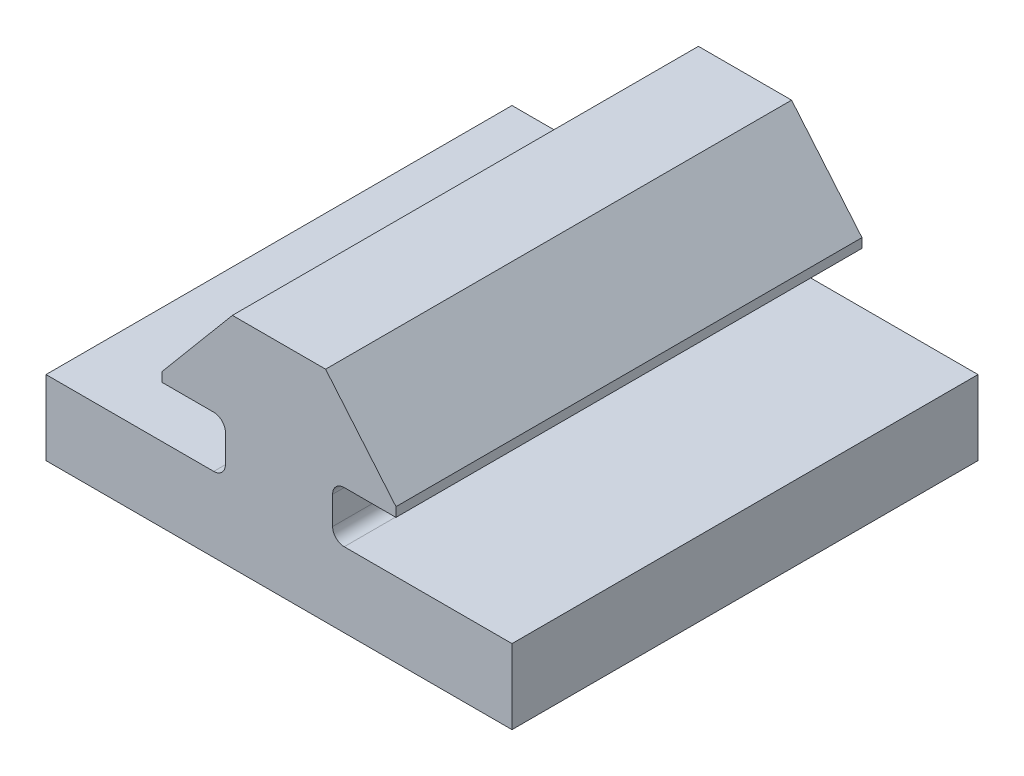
ISO-10303-21;
HEADER;
FILE_DESCRIPTION(('STEP AP214'),'2;1');
FILE_NAME('part.step','',(''),(''),'','','');
FILE_SCHEMA(('AUTOMOTIVE_DESIGN { 1 0 10303 214 1 1 1 1 }'));
ENDSEC;
DATA;
#1=APPLICATION_CONTEXT('core data for automotive mechanical design processes');
#2=APPLICATION_PROTOCOL_DEFINITION('international standard','automotive_design',2000,#1);
#3=PRODUCT_CONTEXT('',#1,'mechanical');
#4=PRODUCT('Part','Part','',(#3));
#5=PRODUCT_RELATED_PRODUCT_CATEGORY('part','',(#4));
#6=PRODUCT_DEFINITION_FORMATION('','',#4);
#7=PRODUCT_DEFINITION_CONTEXT('part definition',#1,'design');
#8=PRODUCT_DEFINITION('design','',#6,#7);
#9=PRODUCT_DEFINITION_SHAPE('','',#8);
#10=(LENGTH_UNIT() NAMED_UNIT(*) SI_UNIT(.MILLI.,.METRE.));
#11=(NAMED_UNIT(*) PLANE_ANGLE_UNIT() SI_UNIT($,.RADIAN.));
#12=(NAMED_UNIT(*) SI_UNIT($,.STERADIAN.) SOLID_ANGLE_UNIT());
#13=UNCERTAINTY_MEASURE_WITH_UNIT(LENGTH_MEASURE(1.E-05),#10,'distance_accuracy_value','');
#14=(GEOMETRIC_REPRESENTATION_CONTEXT(3) GLOBAL_UNCERTAINTY_ASSIGNED_CONTEXT((#13)) GLOBAL_UNIT_ASSIGNED_CONTEXT((#10,
#11,#12)) REPRESENTATION_CONTEXT('',''));
#15=CARTESIAN_POINT('',(0.,0.,0.));
#16=DIRECTION('',(0.,0.,1.));
#17=DIRECTION('',(1.,0.,0.));
#18=AXIS2_PLACEMENT_3D('',#15,#16,#17);
#19=CARTESIAN_POINT('',(12.7,0.,-3683.));
#20=DIRECTION('',(1.,0.,0.));
#21=DIRECTION('',(0.,0.,-1.));
#22=AXIS2_PLACEMENT_3D('',#19,#20,#21);
#23=PLANE('',#22);
#24=DIRECTION('',(0.,1.,0.));
#25=VECTOR('',#24,1.);
#26=CARTESIAN_POINT('',(12.7,0.,-3657.6));
#27=LINE('',#26,#25);
#28=CARTESIAN_POINT('',(12.7,0.,-3657.6));
#29=VERTEX_POINT('',#28);
#30=CARTESIAN_POINT('',(12.7,4.064,-3657.6));
#31=VERTEX_POINT('',#30);
#32=EDGE_CURVE('E301',#29,#31,#27,.T.);
#33=ORIENTED_EDGE('',*,*,#32,.F.);
#34=DIRECTION('',(0.,0.,1.));
#35=VECTOR('',#34,1.);
#36=CARTESIAN_POINT('',(12.7,0.,-3683.));
#37=LINE('',#36,#35);
#38=CARTESIAN_POINT('',(12.7,0.,-3683.));
#39=VERTEX_POINT('',#38);
#40=EDGE_CURVE('E42',#39,#29,#37,.T.);
#41=ORIENTED_EDGE('',*,*,#40,.F.);
#42=DIRECTION('',(0.,1.,0.));
#43=VECTOR('',#42,1.);
#44=CARTESIAN_POINT('',(12.7,0.,-3683.));
#45=LINE('',#44,#43);
#46=CARTESIAN_POINT('',(12.7,4.064,-3683.));
#47=VERTEX_POINT('',#46);
#48=EDGE_CURVE('E275',#39,#47,#45,.T.);
#49=ORIENTED_EDGE('',*,*,#48,.T.);
#50=DIRECTION('',(0.,0.,1.));
#51=VECTOR('',#50,1.);
#52=CARTESIAN_POINT('',(12.7,4.064,-3683.));
#53=LINE('',#52,#51);
#54=EDGE_CURVE('E270',#47,#31,#53,.T.);
#55=ORIENTED_EDGE('',*,*,#54,.T.);
#56=EDGE_LOOP('',(#33,#41,#49,#55));
#57=FACE_BOUND('',#56,.T.);
#58=ADVANCED_FACE('F35',(#57),#23,.T.);
#59=CARTESIAN_POINT('',(12.7,4.064,-3683.));
#60=DIRECTION('',(0.,1.,0.));
#61=DIRECTION('',(0.,0.,1.));
#62=AXIS2_PLACEMENT_3D('',#59,#60,#61);
#63=PLANE('',#62);
#64=DIRECTION('',(-1.,0.,0.));
#65=VECTOR('',#64,1.);
#66=CARTESIAN_POINT('',(12.7,4.064,-3657.6));
#67=LINE('',#66,#65);
#68=CARTESIAN_POINT('',(3.556,4.064,-3657.6));
#69=VERTEX_POINT('',#68);
#70=EDGE_CURVE('E293',#31,#69,#67,.T.);
#71=ORIENTED_EDGE('',*,*,#70,.F.);
#72=ORIENTED_EDGE('',*,*,#54,.F.);
#73=DIRECTION('',(-1.,0.,0.));
#74=VECTOR('',#73,1.);
#75=CARTESIAN_POINT('',(12.7,4.064,-3683.));
#76=LINE('',#75,#74);
#77=CARTESIAN_POINT('',(3.556,4.064,-3683.));
#78=VERTEX_POINT('',#77);
#79=EDGE_CURVE('E266',#47,#78,#76,.T.);
#80=ORIENTED_EDGE('',*,*,#79,.T.);
#81=DIRECTION('',(0.,0.,1.));
#82=VECTOR('',#81,1.);
#83=CARTESIAN_POINT('',(3.556,4.064,-3683.));
#84=LINE('',#83,#82);
#85=EDGE_CURVE('E261',#78,#69,#84,.T.);
#86=ORIENTED_EDGE('',*,*,#85,.T.);
#87=EDGE_LOOP('',(#71,#72,#80,#86));
#88=FACE_BOUND('',#87,.T.);
#89=ADVANCED_FACE('F291',(#88),#63,.T.);
#90=CARTESIAN_POINT('',(3.55599999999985,4.69899999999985,-3683.));
#91=DIRECTION('',(0.,0.,-1.));
#92=DIRECTION('',(0.707106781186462,0.707106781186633,0.));
#93=AXIS2_PLACEMENT_3D('',#90,#91,#92);
#94=CYLINDRICAL_SURFACE('',#93,0.634999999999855);
#95=DIRECTION('',(0.,0.,1.));
#96=VECTOR('',#95,1.);
#97=CARTESIAN_POINT('',(2.921,4.69899999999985,-3683.));
#98=LINE('',#97,#96);
#99=CARTESIAN_POINT('',(2.921,4.69899999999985,-3683.));
#100=VERTEX_POINT('',#99);
#101=CARTESIAN_POINT('',(2.921,4.69899999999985,-3657.6));
#102=VERTEX_POINT('',#101);
#103=EDGE_CURVE('E256',#100,#102,#98,.T.);
#104=ORIENTED_EDGE('',*,*,#103,.T.);
#105=CARTESIAN_POINT('',(3.55599999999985,4.69899999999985,-3657.6));
#106=DIRECTION('',(0.,0.,-1.));
#107=DIRECTION('',(-1.,0.,0.));
#108=AXIS2_PLACEMENT_3D('',#105,#106,#107);
#109=CIRCLE('',#108,0.634999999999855);
#110=EDGE_CURVE('E298',#102,#69,#109,.F.);
#111=ORIENTED_EDGE('',*,*,#110,.T.);
#112=ORIENTED_EDGE('',*,*,#85,.F.);
#113=CARTESIAN_POINT('',(3.55599999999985,4.69899999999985,-3683.));
#114=DIRECTION('',(0.,0.,1.));
#115=DIRECTION('',(1.,0.,0.));
#116=AXIS2_PLACEMENT_3D('',#113,#114,#115);
#117=CIRCLE('',#116,0.634999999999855);
#118=EDGE_CURVE('E251',#100,#78,#117,.T.);
#119=ORIENTED_EDGE('',*,*,#118,.F.);
#120=EDGE_LOOP('',(#104,#111,#112,#119));
#121=FACE_BOUND('',#120,.T.);
#122=ADVANCED_FACE('F430',(#121),#94,.F.);
#123=CARTESIAN_POINT('',(3.55599999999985,4.69899999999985,-3683.));
#124=DIRECTION('',(0.,0.,1.));
#125=DIRECTION('',(1.,0.,0.));
#126=AXIS2_PLACEMENT_3D('',#123,#124,#125);
#127=PLANE('',#126);
#128=DIRECTION('',(-1.,0.,0.));
#129=VECTOR('',#128,1.);
#130=CARTESIAN_POINT('',(-3.556,4.064,-3683.));
#131=LINE('',#130,#129);
#132=CARTESIAN_POINT('',(-3.55599999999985,4.064,-3683.));
#133=VERTEX_POINT('',#132);
#134=CARTESIAN_POINT('',(-12.7,4.064,-3683.));
#135=VERTEX_POINT('',#134);
#136=EDGE_CURVE('E175',#133,#135,#131,.T.);
#137=ORIENTED_EDGE('',*,*,#136,.F.);
#138=CARTESIAN_POINT('',(-3.55599999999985,4.69899999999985,-3683.));
#139=DIRECTION('',(0.,0.,1.));
#140=DIRECTION('',(1.,0.,0.));
#141=AXIS2_PLACEMENT_3D('',#138,#139,#140);
#142=CIRCLE('',#141,0.634999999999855);
#143=CARTESIAN_POINT('',(-2.921,4.699,-3683.));
#144=VERTEX_POINT('',#143);
#145=EDGE_CURVE('E244',#133,#144,#142,.T.);
#146=ORIENTED_EDGE('',*,*,#145,.T.);
#147=DIRECTION('',(0.,-1.,0.));
#148=VECTOR('',#147,1.);
#149=CARTESIAN_POINT('',(-2.921,6.223,-3683.));
#150=LINE('',#149,#148);
#151=CARTESIAN_POINT('',(-2.921,6.22300000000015,-3683.));
#152=VERTEX_POINT('',#151);
#153=EDGE_CURVE('E239',#152,#144,#150,.T.);
#154=ORIENTED_EDGE('',*,*,#153,.F.);
#155=CARTESIAN_POINT('',(-3.55599999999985,6.22300000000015,-3683.));
#156=DIRECTION('',(0.,0.,1.));
#157=DIRECTION('',(1.,0.,0.));
#158=AXIS2_PLACEMENT_3D('',#155,#156,#157);
#159=CIRCLE('',#158,0.634999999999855);
#160=CARTESIAN_POINT('',(-3.556,6.858,-3683.));
#161=VERTEX_POINT('',#160);
#162=EDGE_CURVE('E235',#152,#161,#159,.T.);
#163=ORIENTED_EDGE('',*,*,#162,.T.);
#164=DIRECTION('',(1.,0.,0.));
#165=VECTOR('',#164,1.);
#166=CARTESIAN_POINT('',(-6.376363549,6.858,-3683.));
#167=LINE('',#166,#165);
#168=CARTESIAN_POINT('',(-6.376363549,6.858,-3683.));
#169=VERTEX_POINT('',#168);
#170=EDGE_CURVE('E230',#169,#161,#167,.T.);
#171=ORIENTED_EDGE('',*,*,#170,.F.);
#172=DIRECTION('',(0.,-1.,0.));
#173=VECTOR('',#172,1.);
#174=CARTESIAN_POINT('',(-6.376363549,7.36599995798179,-3683.));
#175=LINE('',#174,#173);
#176=CARTESIAN_POINT('',(-6.376363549,7.36599995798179,-3683.));
#177=VERTEX_POINT('',#176);
#178=EDGE_CURVE('E225',#177,#169,#175,.T.);
#179=ORIENTED_EDGE('',*,*,#178,.F.);
#180=DIRECTION('',(-0.642787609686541,-0.766044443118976,0.));
#181=VECTOR('',#180,1.);
#182=CARTESIAN_POINT('',(-2.54,11.938,-3683.));
#183=LINE('',#182,#181);
#184=CARTESIAN_POINT('',(-2.54,11.938,-3683.));
#185=VERTEX_POINT('',#184);
#186=EDGE_CURVE('E220',#185,#177,#183,.T.);
#187=ORIENTED_EDGE('',*,*,#186,.F.);
#188=DIRECTION('',(-1.,0.,0.));
#189=VECTOR('',#188,1.);
#190=CARTESIAN_POINT('',(2.54,11.938,-3683.));
#191=LINE('',#190,#189);
#192=CARTESIAN_POINT('',(2.54,11.938,-3683.));
#193=VERTEX_POINT('',#192);
#194=EDGE_CURVE('E215',#193,#185,#191,.T.);
#195=ORIENTED_EDGE('',*,*,#194,.F.);
#196=DIRECTION('',(-0.642787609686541,0.766044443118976,0.));
#197=VECTOR('',#196,1.);
#198=CARTESIAN_POINT('',(6.376363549,7.36599995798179,-3683.));
#199=LINE('',#198,#197);
#200=CARTESIAN_POINT('',(6.376363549,7.36599995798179,-3683.));
#201=VERTEX_POINT('',#200);
#202=EDGE_CURVE('E210',#201,#193,#199,.T.);
#203=ORIENTED_EDGE('',*,*,#202,.F.);
#204=DIRECTION('',(0.,1.,0.));
#205=VECTOR('',#204,1.);
#206=CARTESIAN_POINT('',(6.376363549,6.858,-3683.));
#207=LINE('',#206,#205);
#208=CARTESIAN_POINT('',(6.376363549,6.858,-3683.));
#209=VERTEX_POINT('',#208);
#210=EDGE_CURVE('E205',#209,#201,#207,.T.);
#211=ORIENTED_EDGE('',*,*,#210,.F.);
#212=DIRECTION('',(1.,0.,0.));
#213=VECTOR('',#212,1.);
#214=CARTESIAN_POINT('',(3.556,6.858,-3683.));
#215=LINE('',#214,#213);
#216=CARTESIAN_POINT('',(3.55599999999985,6.858,-3683.));
#217=VERTEX_POINT('',#216);
#218=EDGE_CURVE('E200',#217,#209,#215,.T.);
#219=ORIENTED_EDGE('',*,*,#218,.F.);
#220=CARTESIAN_POINT('',(3.55599999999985,6.22300000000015,-3683.));
#221=DIRECTION('',(0.,0.,1.));
#222=DIRECTION('',(1.,0.,0.));
#223=AXIS2_PLACEMENT_3D('',#220,#221,#222);
#224=CIRCLE('',#223,0.634999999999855);
#225=CARTESIAN_POINT('',(2.921,6.223,-3683.));
#226=VERTEX_POINT('',#225);
#227=EDGE_CURVE('E196',#217,#226,#224,.T.);
#228=ORIENTED_EDGE('',*,*,#227,.T.);
#229=DIRECTION('',(0.,1.,0.));
#230=VECTOR('',#229,1.);
#231=CARTESIAN_POINT('',(2.921,4.699,-3683.));
#232=LINE('',#231,#230);
#233=EDGE_CURVE('E191',#100,#226,#232,.T.);
#234=ORIENTED_EDGE('',*,*,#233,.F.);
#235=ORIENTED_EDGE('',*,*,#118,.T.);
#236=ORIENTED_EDGE('',*,*,#79,.F.);
#237=ORIENTED_EDGE('',*,*,#48,.F.);
#238=DIRECTION('',(1.,0.,0.));
#239=VECTOR('',#238,1.);
#240=CARTESIAN_POINT('',(-12.7,0.,-3683.));
#241=LINE('',#240,#239);
#242=CARTESIAN_POINT('',(-12.7,0.,-3683.));
#243=VERTEX_POINT('',#242);
#244=EDGE_CURVE('E178',#243,#39,#241,.T.);
#245=ORIENTED_EDGE('',*,*,#244,.F.);
#246=DIRECTION('',(0.,-1.,0.));
#247=VECTOR('',#246,1.);
#248=CARTESIAN_POINT('',(-12.7,4.064,-3683.));
#249=LINE('',#248,#247);
#250=EDGE_CURVE('E176',#135,#243,#249,.T.);
#251=ORIENTED_EDGE('',*,*,#250,.F.);
#252=EDGE_LOOP('',(#137,#146,#154,#163,#171,#179,#187,#195,#203,#211,#219,#228,#234,#235,#236,
#237,#245,#251));
#253=FACE_BOUND('',#252,.T.);
#254=ADVANCED_FACE('F286',(#253),#127,.F.);
#255=CARTESIAN_POINT('',(-12.7,4.064,-3683.));
#256=DIRECTION('',(-1.,0.,0.));
#257=DIRECTION('',(0.,0.,1.));
#258=AXIS2_PLACEMENT_3D('',#255,#256,#257);
#259=PLANE('',#258);
#260=DIRECTION('',(0.,-1.,0.));
#261=VECTOR('',#260,1.);
#262=CARTESIAN_POINT('',(-12.7,4.064,-3657.6));
#263=LINE('',#262,#261);
#264=CARTESIAN_POINT('',(-12.7,4.064,-3657.6));
#265=VERTEX_POINT('',#264);
#266=CARTESIAN_POINT('',(-12.7,0.,-3657.6));
#267=VERTEX_POINT('',#266);
#268=EDGE_CURVE('E157',#265,#267,#263,.T.);
#269=ORIENTED_EDGE('',*,*,#268,.F.);
#270=DIRECTION('',(0.,0.,1.));
#271=VECTOR('',#270,1.);
#272=CARTESIAN_POINT('',(-12.7,4.064,-3683.));
#273=LINE('',#272,#271);
#274=EDGE_CURVE('E168',#135,#265,#273,.T.);
#275=ORIENTED_EDGE('',*,*,#274,.F.);
#276=ORIENTED_EDGE('',*,*,#250,.T.);
#277=DIRECTION('',(0.,0.,1.));
#278=VECTOR('',#277,1.);
#279=CARTESIAN_POINT('',(-12.7,0.,-3683.));
#280=LINE('',#279,#278);
#281=EDGE_CURVE('E171',#243,#267,#280,.T.);
#282=ORIENTED_EDGE('',*,*,#281,.T.);
#283=EDGE_LOOP('',(#269,#275,#276,#282));
#284=FACE_BOUND('',#283,.T.);
#285=ADVANCED_FACE('F166',(#284),#259,.T.);
#286=CARTESIAN_POINT('',(-12.7,0.,-3683.));
#287=DIRECTION('',(0.,-1.,0.));
#288=DIRECTION('',(0.,0.,-1.));
#289=AXIS2_PLACEMENT_3D('',#286,#287,#288);
#290=PLANE('',#289);
#291=DIRECTION('',(1.,0.,0.));
#292=VECTOR('',#291,1.);
#293=CARTESIAN_POINT('',(-12.7,0.,-3657.6));
#294=LINE('',#293,#292);
#295=EDGE_CURVE('E284',#267,#29,#294,.T.);
#296=ORIENTED_EDGE('',*,*,#295,.F.);
#297=ORIENTED_EDGE('',*,*,#281,.F.);
#298=ORIENTED_EDGE('',*,*,#244,.T.);
#299=ORIENTED_EDGE('',*,*,#40,.T.);
#300=EDGE_LOOP('',(#296,#297,#298,#299));
#301=FACE_BOUND('',#300,.T.);
#302=ADVANCED_FACE('F283',(#301),#290,.T.);
#303=CARTESIAN_POINT('',(-3.55599999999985,4.69899999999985,-3683.));
#304=DIRECTION('',(0.,0.,-1.));
#305=DIRECTION('',(-0.707106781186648,0.707106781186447,0.));
#306=AXIS2_PLACEMENT_3D('',#303,#304,#305);
#307=CYLINDRICAL_SURFACE('',#306,0.634999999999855);
#308=DIRECTION('',(0.,0.,1.));
#309=VECTOR('',#308,1.);
#310=CARTESIAN_POINT('',(-3.55599999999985,4.064,-3683.));
#311=LINE('',#310,#309);
#312=CARTESIAN_POINT('',(-3.55599999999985,4.064,-3657.6));
#313=VERTEX_POINT('',#312);
#314=EDGE_CURVE('E180',#133,#313,#311,.T.);
#315=ORIENTED_EDGE('',*,*,#314,.T.);
#316=CARTESIAN_POINT('',(-3.55599999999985,4.69899999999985,-3657.6));
#317=DIRECTION('',(0.,0.,-1.));
#318=DIRECTION('',(-1.,0.,0.));
#319=AXIS2_PLACEMENT_3D('',#316,#317,#318);
#320=CIRCLE('',#319,0.634999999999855);
#321=CARTESIAN_POINT('',(-2.921,4.699,-3657.6));
#322=VERTEX_POINT('',#321);
#323=EDGE_CURVE('E48',#313,#322,#320,.F.);
#324=ORIENTED_EDGE('',*,*,#323,.T.);
#325=DIRECTION('',(0.,0.,1.));
#326=VECTOR('',#325,1.);
#327=CARTESIAN_POINT('',(-2.921,4.699,-3683.));
#328=LINE('',#327,#326);
#329=EDGE_CURVE('E371',#144,#322,#328,.T.);
#330=ORIENTED_EDGE('',*,*,#329,.F.);
#331=ORIENTED_EDGE('',*,*,#145,.F.);
#332=EDGE_LOOP('',(#315,#324,#330,#331));
#333=FACE_BOUND('',#332,.T.);
#334=ADVANCED_FACE('F382',(#333),#307,.F.);
#335=CARTESIAN_POINT('',(-2.921,6.223,-3683.));
#336=DIRECTION('',(-1.,0.,0.));
#337=DIRECTION('',(0.,0.,1.));
#338=AXIS2_PLACEMENT_3D('',#335,#336,#337);
#339=PLANE('',#338);
#340=DIRECTION('',(0.,-1.,0.));
#341=VECTOR('',#340,1.);
#342=CARTESIAN_POINT('',(-2.921,6.223,-3657.6));
#343=LINE('',#342,#341);
#344=CARTESIAN_POINT('',(-2.921,6.22300000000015,-3657.6));
#345=VERTEX_POINT('',#344);
#346=EDGE_CURVE('E172',#345,#322,#343,.T.);
#347=ORIENTED_EDGE('',*,*,#346,.F.);
#348=DIRECTION('',(0.,0.,1.));
#349=VECTOR('',#348,1.);
#350=CARTESIAN_POINT('',(-2.921,6.22300000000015,-3683.));
#351=LINE('',#350,#349);
#352=EDGE_CURVE('E366',#152,#345,#351,.T.);
#353=ORIENTED_EDGE('',*,*,#352,.F.);
#354=ORIENTED_EDGE('',*,*,#153,.T.);
#355=ORIENTED_EDGE('',*,*,#329,.T.);
#356=EDGE_LOOP('',(#347,#353,#354,#355));
#357=FACE_BOUND('',#356,.T.);
#358=ADVANCED_FACE('F389',(#357),#339,.T.);
#359=CARTESIAN_POINT('',(-3.55599999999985,6.22300000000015,-3683.));
#360=DIRECTION('',(0.,0.,-1.));
#361=DIRECTION('',(-0.707106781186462,-0.707106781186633,0.));
#362=AXIS2_PLACEMENT_3D('',#359,#360,#361);
#363=CYLINDRICAL_SURFACE('',#362,0.634999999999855);
#364=ORIENTED_EDGE('',*,*,#352,.T.);
#365=CARTESIAN_POINT('',(-3.55599999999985,6.22300000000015,-3657.6));
#366=DIRECTION('',(0.,0.,-1.));
#367=DIRECTION('',(-1.,0.,0.));
#368=AXIS2_PLACEMENT_3D('',#365,#366,#367);
#369=CIRCLE('',#368,0.634999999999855);
#370=CARTESIAN_POINT('',(-3.556,6.858,-3657.6));
#371=VERTEX_POINT('',#370);
#372=EDGE_CURVE('E296',#345,#371,#369,.F.);
#373=ORIENTED_EDGE('',*,*,#372,.T.);
#374=DIRECTION('',(0.,0.,1.));
#375=VECTOR('',#374,1.);
#376=CARTESIAN_POINT('',(-3.556,6.858,-3683.));
#377=LINE('',#376,#375);
#378=EDGE_CURVE('E361',#161,#371,#377,.T.);
#379=ORIENTED_EDGE('',*,*,#378,.F.);
#380=ORIENTED_EDGE('',*,*,#162,.F.);
#381=EDGE_LOOP('',(#364,#373,#379,#380));
#382=FACE_BOUND('',#381,.T.);
#383=ADVANCED_FACE('F391',(#382),#363,.F.);
#384=CARTESIAN_POINT('',(-6.376363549,6.858,-3683.));
#385=DIRECTION('',(0.,-1.,0.));
#386=DIRECTION('',(0.,0.,-1.));
#387=AXIS2_PLACEMENT_3D('',#384,#385,#386);
#388=PLANE('',#387);
#389=DIRECTION('',(1.,0.,0.));
#390=VECTOR('',#389,1.);
#391=CARTESIAN_POINT('',(-6.376363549,6.858,-3657.6));
#392=LINE('',#391,#390);
#393=CARTESIAN_POINT('',(-6.376363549,6.858,-3657.6));
#394=VERTEX_POINT('',#393);
#395=EDGE_CURVE('E295',#394,#371,#392,.T.);
#396=ORIENTED_EDGE('',*,*,#395,.F.);
#397=DIRECTION('',(0.,0.,1.));
#398=VECTOR('',#397,1.);
#399=CARTESIAN_POINT('',(-6.376363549,6.858,-3683.));
#400=LINE('',#399,#398);
#401=EDGE_CURVE('E356',#169,#394,#400,.T.);
#402=ORIENTED_EDGE('',*,*,#401,.F.);
#403=ORIENTED_EDGE('',*,*,#170,.T.);
#404=ORIENTED_EDGE('',*,*,#378,.T.);
#405=EDGE_LOOP('',(#396,#402,#403,#404));
#406=FACE_BOUND('',#405,.T.);
#407=ADVANCED_FACE('F395',(#406),#388,.T.);
#408=CARTESIAN_POINT('',(-6.376363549,7.36599995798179,-3683.));
#409=DIRECTION('',(-1.,0.,0.));
#410=DIRECTION('',(0.,0.,1.));
#411=AXIS2_PLACEMENT_3D('',#408,#409,#410);
#412=PLANE('',#411);
#413=DIRECTION('',(0.,-1.,0.));
#414=VECTOR('',#413,1.);
#415=CARTESIAN_POINT('',(-6.376363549,7.36599995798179,-3657.6));
#416=LINE('',#415,#414);
#417=CARTESIAN_POINT('',(-6.376363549,7.36599995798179,-3657.6));
#418=VERTEX_POINT('',#417);
#419=EDGE_CURVE('E321',#418,#394,#416,.T.);
#420=ORIENTED_EDGE('',*,*,#419,.F.);
#421=DIRECTION('',(0.,0.,1.));
#422=VECTOR('',#421,1.);
#423=CARTESIAN_POINT('',(-6.376363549,7.36599995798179,-3683.));
#424=LINE('',#423,#422);
#425=EDGE_CURVE('E351',#177,#418,#424,.T.);
#426=ORIENTED_EDGE('',*,*,#425,.F.);
#427=ORIENTED_EDGE('',*,*,#178,.T.);
#428=ORIENTED_EDGE('',*,*,#401,.T.);
#429=EDGE_LOOP('',(#420,#426,#427,#428));
#430=FACE_BOUND('',#429,.T.);
#431=ADVANCED_FACE('F400',(#430),#412,.T.);
#432=CARTESIAN_POINT('',(-2.54,11.938,-3683.));
#433=DIRECTION('',(-0.766044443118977,0.642787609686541,0.));
#434=DIRECTION('',(-0.642787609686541,-0.766044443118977,0.));
#435=AXIS2_PLACEMENT_3D('',#432,#433,#434);
#436=PLANE('',#435);
#437=DIRECTION('',(-0.642787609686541,-0.766044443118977,0.));
#438=VECTOR('',#437,1.);
#439=CARTESIAN_POINT('',(-2.54,11.938,-3657.6));
#440=LINE('',#439,#438);
#441=CARTESIAN_POINT('',(-2.54,11.938,-3657.6));
#442=VERTEX_POINT('',#441);
#443=EDGE_CURVE('E319',#442,#418,#440,.T.);
#444=ORIENTED_EDGE('',*,*,#443,.F.);
#445=DIRECTION('',(0.,0.,1.));
#446=VECTOR('',#445,1.);
#447=CARTESIAN_POINT('',(-2.54,11.938,-3683.));
#448=LINE('',#447,#446);
#449=EDGE_CURVE('E346',#185,#442,#448,.T.);
#450=ORIENTED_EDGE('',*,*,#449,.F.);
#451=ORIENTED_EDGE('',*,*,#186,.T.);
#452=ORIENTED_EDGE('',*,*,#425,.T.);
#453=EDGE_LOOP('',(#444,#450,#451,#452));
#454=FACE_BOUND('',#453,.T.);
#455=ADVANCED_FACE('F403',(#454),#436,.T.);
#456=CARTESIAN_POINT('',(2.54,11.938,-3683.));
#457=DIRECTION('',(0.,1.,0.));
#458=DIRECTION('',(0.,0.,1.));
#459=AXIS2_PLACEMENT_3D('',#456,#457,#458);
#460=PLANE('',#459);
#461=DIRECTION('',(-1.,0.,0.));
#462=VECTOR('',#461,1.);
#463=CARTESIAN_POINT('',(2.54,11.938,-3657.6));
#464=LINE('',#463,#462);
#465=CARTESIAN_POINT('',(2.54,11.938,-3657.6));
#466=VERTEX_POINT('',#465);
#467=EDGE_CURVE('E317',#466,#442,#464,.T.);
#468=ORIENTED_EDGE('',*,*,#467,.F.);
#469=DIRECTION('',(0.,0.,1.));
#470=VECTOR('',#469,1.);
#471=CARTESIAN_POINT('',(2.54,11.938,-3683.));
#472=LINE('',#471,#470);
#473=EDGE_CURVE('E341',#193,#466,#472,.T.);
#474=ORIENTED_EDGE('',*,*,#473,.F.);
#475=ORIENTED_EDGE('',*,*,#194,.T.);
#476=ORIENTED_EDGE('',*,*,#449,.T.);
#477=EDGE_LOOP('',(#468,#474,#475,#476));
#478=FACE_BOUND('',#477,.T.);
#479=ADVANCED_FACE('F407',(#478),#460,.T.);
#480=CARTESIAN_POINT('',(6.376363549,7.36599995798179,-3683.));
#481=DIRECTION('',(0.766044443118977,0.642787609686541,0.));
#482=DIRECTION('',(-0.642787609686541,0.766044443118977,0.));
#483=AXIS2_PLACEMENT_3D('',#480,#481,#482);
#484=PLANE('',#483);
#485=DIRECTION('',(-0.642787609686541,0.766044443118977,0.));
#486=VECTOR('',#485,1.);
#487=CARTESIAN_POINT('',(6.376363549,7.36599995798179,-3657.6));
#488=LINE('',#487,#486);
#489=CARTESIAN_POINT('',(6.376363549,7.36599995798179,-3657.6));
#490=VERTEX_POINT('',#489);
#491=EDGE_CURVE('E315',#490,#466,#488,.T.);
#492=ORIENTED_EDGE('',*,*,#491,.F.);
#493=DIRECTION('',(0.,0.,1.));
#494=VECTOR('',#493,1.);
#495=CARTESIAN_POINT('',(6.376363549,7.36599995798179,-3683.));
#496=LINE('',#495,#494);
#497=EDGE_CURVE('E336',#201,#490,#496,.T.);
#498=ORIENTED_EDGE('',*,*,#497,.F.);
#499=ORIENTED_EDGE('',*,*,#202,.T.);
#500=ORIENTED_EDGE('',*,*,#473,.T.);
#501=EDGE_LOOP('',(#492,#498,#499,#500));
#502=FACE_BOUND('',#501,.T.);
#503=ADVANCED_FACE('F412',(#502),#484,.T.);
#504=CARTESIAN_POINT('',(6.376363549,6.858,-3683.));
#505=DIRECTION('',(1.,0.,0.));
#506=DIRECTION('',(0.,0.,-1.));
#507=AXIS2_PLACEMENT_3D('',#504,#505,#506);
#508=PLANE('',#507);
#509=DIRECTION('',(0.,1.,0.));
#510=VECTOR('',#509,1.);
#511=CARTESIAN_POINT('',(6.376363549,6.858,-3657.6));
#512=LINE('',#511,#510);
#513=CARTESIAN_POINT('',(6.376363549,6.858,-3657.6));
#514=VERTEX_POINT('',#513);
#515=EDGE_CURVE('E313',#514,#490,#512,.T.);
#516=ORIENTED_EDGE('',*,*,#515,.F.);
#517=DIRECTION('',(0.,0.,1.));
#518=VECTOR('',#517,1.);
#519=CARTESIAN_POINT('',(6.376363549,6.858,-3683.));
#520=LINE('',#519,#518);
#521=EDGE_CURVE('E331',#209,#514,#520,.T.);
#522=ORIENTED_EDGE('',*,*,#521,.F.);
#523=ORIENTED_EDGE('',*,*,#210,.T.);
#524=ORIENTED_EDGE('',*,*,#497,.T.);
#525=EDGE_LOOP('',(#516,#522,#523,#524));
#526=FACE_BOUND('',#525,.T.);
#527=ADVANCED_FACE('F415',(#526),#508,.T.);
#528=CARTESIAN_POINT('',(3.556,6.858,-3683.));
#529=DIRECTION('',(0.,-1.,0.));
#530=DIRECTION('',(0.,0.,-1.));
#531=AXIS2_PLACEMENT_3D('',#528,#529,#530);
#532=PLANE('',#531);
#533=DIRECTION('',(1.,0.,0.));
#534=VECTOR('',#533,1.);
#535=CARTESIAN_POINT('',(3.556,6.858,-3657.6));
#536=LINE('',#535,#534);
#537=CARTESIAN_POINT('',(3.55599999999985,6.858,-3657.6));
#538=VERTEX_POINT('',#537);
#539=EDGE_CURVE('E311',#538,#514,#536,.T.);
#540=ORIENTED_EDGE('',*,*,#539,.F.);
#541=DIRECTION('',(0.,0.,1.));
#542=VECTOR('',#541,1.);
#543=CARTESIAN_POINT('',(3.55599999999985,6.858,-3683.));
#544=LINE('',#543,#542);
#545=EDGE_CURVE('E326',#217,#538,#544,.T.);
#546=ORIENTED_EDGE('',*,*,#545,.F.);
#547=ORIENTED_EDGE('',*,*,#218,.T.);
#548=ORIENTED_EDGE('',*,*,#521,.T.);
#549=EDGE_LOOP('',(#540,#546,#547,#548));
#550=FACE_BOUND('',#549,.T.);
#551=ADVANCED_FACE('F419',(#550),#532,.T.);
#552=CARTESIAN_POINT('',(3.55599999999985,6.22300000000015,-3683.));
#553=DIRECTION('',(0.,0.,-1.));
#554=DIRECTION('',(0.707106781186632,-0.707106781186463,0.));
#555=AXIS2_PLACEMENT_3D('',#552,#553,#554);
#556=CYLINDRICAL_SURFACE('',#555,0.634999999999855);
#557=ORIENTED_EDGE('',*,*,#545,.T.);
#558=CARTESIAN_POINT('',(3.55599999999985,6.22300000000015,-3657.6));
#559=DIRECTION('',(0.,0.,-1.));
#560=DIRECTION('',(-1.,0.,0.));
#561=AXIS2_PLACEMENT_3D('',#558,#559,#560);
#562=CIRCLE('',#561,0.634999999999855);
#563=CARTESIAN_POINT('',(2.921,6.223,-3657.6));
#564=VERTEX_POINT('',#563);
#565=EDGE_CURVE('E308',#538,#564,#562,.F.);
#566=ORIENTED_EDGE('',*,*,#565,.T.);
#567=DIRECTION('',(0.,0.,1.));
#568=VECTOR('',#567,1.);
#569=CARTESIAN_POINT('',(2.921,6.223,-3683.));
#570=LINE('',#569,#568);
#571=EDGE_CURVE('E323',#226,#564,#570,.T.);
#572=ORIENTED_EDGE('',*,*,#571,.F.);
#573=ORIENTED_EDGE('',*,*,#227,.F.);
#574=EDGE_LOOP('',(#557,#566,#572,#573));
#575=FACE_BOUND('',#574,.T.);
#576=ADVANCED_FACE('F425',(#575),#556,.F.);
#577=CARTESIAN_POINT('',(2.921,4.699,-3683.));
#578=DIRECTION('',(1.,0.,0.));
#579=DIRECTION('',(0.,0.,-1.));
#580=AXIS2_PLACEMENT_3D('',#577,#578,#579);
#581=PLANE('',#580);
#582=DIRECTION('',(0.,1.,0.));
#583=VECTOR('',#582,1.);
#584=CARTESIAN_POINT('',(2.921,4.699,-3657.6));
#585=LINE('',#584,#583);
#586=EDGE_CURVE('E306',#102,#564,#585,.T.);
#587=ORIENTED_EDGE('',*,*,#586,.F.);
#588=ORIENTED_EDGE('',*,*,#103,.F.);
#589=ORIENTED_EDGE('',*,*,#233,.T.);
#590=ORIENTED_EDGE('',*,*,#571,.T.);
#591=EDGE_LOOP('',(#587,#588,#589,#590));
#592=FACE_BOUND('',#591,.T.);
#593=ADVANCED_FACE('F428',(#592),#581,.T.);
#594=CARTESIAN_POINT('',(-3.556,4.064,-3683.));
#595=DIRECTION('',(0.,1.,0.));
#596=DIRECTION('',(0.,0.,1.));
#597=AXIS2_PLACEMENT_3D('',#594,#595,#596);
#598=PLANE('',#597);
#599=DIRECTION('',(-1.,0.,0.));
#600=VECTOR('',#599,1.);
#601=CARTESIAN_POINT('',(-3.556,4.064,-3657.6));
#602=LINE('',#601,#600);
#603=EDGE_CURVE('E11',#313,#265,#602,.T.);
#604=ORIENTED_EDGE('',*,*,#603,.F.);
#605=ORIENTED_EDGE('',*,*,#314,.F.);
#606=ORIENTED_EDGE('',*,*,#136,.T.);
#607=ORIENTED_EDGE('',*,*,#274,.T.);
#608=EDGE_LOOP('',(#604,#605,#606,#607));
#609=FACE_BOUND('',#608,.T.);
#610=ADVANCED_FACE('F174',(#609),#598,.T.);
#611=CARTESIAN_POINT('',(0.,0.,-3657.6));
#612=DIRECTION('',(0.,0.,-1.));
#613=DIRECTION('',(-1.,0.,0.));
#614=AXIS2_PLACEMENT_3D('',#611,#612,#613);
#615=PLANE('',#614);
#616=ORIENTED_EDGE('',*,*,#419,.T.);
#617=ORIENTED_EDGE('',*,*,#395,.T.);
#618=ORIENTED_EDGE('',*,*,#372,.F.);
#619=ORIENTED_EDGE('',*,*,#346,.T.);
#620=ORIENTED_EDGE('',*,*,#323,.F.);
#621=ORIENTED_EDGE('',*,*,#603,.T.);
#622=ORIENTED_EDGE('',*,*,#268,.T.);
#623=ORIENTED_EDGE('',*,*,#295,.T.);
#624=ORIENTED_EDGE('',*,*,#32,.T.);
#625=ORIENTED_EDGE('',*,*,#70,.T.);
#626=ORIENTED_EDGE('',*,*,#110,.F.);
#627=ORIENTED_EDGE('',*,*,#586,.T.);
#628=ORIENTED_EDGE('',*,*,#565,.F.);
#629=ORIENTED_EDGE('',*,*,#539,.T.);
#630=ORIENTED_EDGE('',*,*,#515,.T.);
#631=ORIENTED_EDGE('',*,*,#491,.T.);
#632=ORIENTED_EDGE('',*,*,#467,.T.);
#633=ORIENTED_EDGE('',*,*,#443,.T.);
#634=EDGE_LOOP('',(#616,#617,#618,#619,#620,#621,#622,#623,#624,#625,#626,#627,#628,#629,#630,
#631,#632,#633));
#635=FACE_BOUND('',#634,.T.);
#636=ADVANCED_FACE('F156',(#635),#615,.F.);
#637=CLOSED_SHELL('',(#58,#89,#122,#254,#285,#302,#334,#358,#383,#407,#431,#455,#479,#503,#527,
#551,#576,#593,#610,#636));
#638=MANIFOLD_SOLID_BREP('B2',#637);
#639=ADVANCED_BREP_SHAPE_REPRESENTATION('',(#18,#638),#14);
#640=SHAPE_DEFINITION_REPRESENTATION(#9,#639);
ENDSEC;
END-ISO-10303-21;
